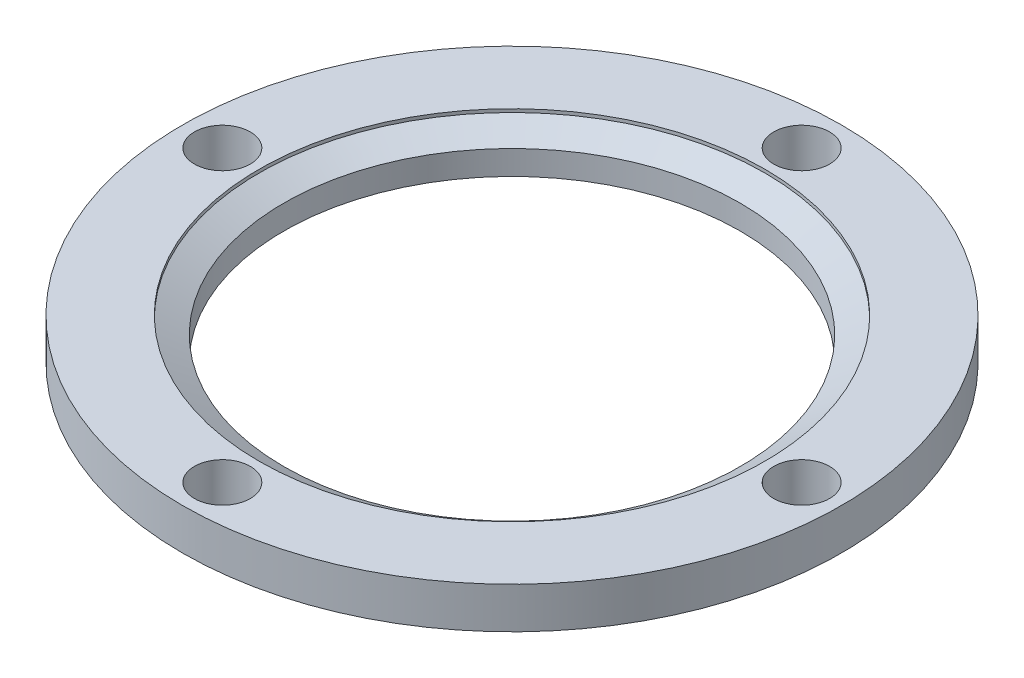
ISO-10303-21;
HEADER;
FILE_DESCRIPTION(('STEP AP214'),'2;1');
FILE_NAME('part.step','',(''),(''),'','','');
FILE_SCHEMA(('AUTOMOTIVE_DESIGN { 1 0 10303 214 1 1 1 1 }'));
ENDSEC;
DATA;
#1=APPLICATION_CONTEXT('core data for automotive mechanical design processes');
#2=APPLICATION_PROTOCOL_DEFINITION('international standard','automotive_design',2000,#1);
#3=PRODUCT_CONTEXT('',#1,'mechanical');
#4=PRODUCT('Part','Part','',(#3));
#5=PRODUCT_RELATED_PRODUCT_CATEGORY('part','',(#4));
#6=PRODUCT_DEFINITION_FORMATION('','',#4);
#7=PRODUCT_DEFINITION_CONTEXT('part definition',#1,'design');
#8=PRODUCT_DEFINITION('design','',#6,#7);
#9=PRODUCT_DEFINITION_SHAPE('','',#8);
#10=(LENGTH_UNIT() NAMED_UNIT(*) SI_UNIT(.MILLI.,.METRE.));
#11=(NAMED_UNIT(*) PLANE_ANGLE_UNIT() SI_UNIT($,.RADIAN.));
#12=(NAMED_UNIT(*) SI_UNIT($,.STERADIAN.) SOLID_ANGLE_UNIT());
#13=UNCERTAINTY_MEASURE_WITH_UNIT(LENGTH_MEASURE(1.E-05),#10,'distance_accuracy_value','');
#14=(GEOMETRIC_REPRESENTATION_CONTEXT(3) GLOBAL_UNCERTAINTY_ASSIGNED_CONTEXT((#13)) GLOBAL_UNIT_ASSIGNED_CONTEXT((#10,
#11,#12)) REPRESENTATION_CONTEXT('',''));
#15=CARTESIAN_POINT('',(0.,0.,0.));
#16=DIRECTION('',(0.,0.,1.));
#17=DIRECTION('',(1.,0.,0.));
#18=AXIS2_PLACEMENT_3D('',#15,#16,#17);
#19=CARTESIAN_POINT('',(0.,0.,0.));
#20=DIRECTION('',(0.,-1.,0.));
#21=DIRECTION('',(0.,0.,-1.));
#22=AXIS2_PLACEMENT_3D('',#19,#20,#21);
#23=CYLINDRICAL_SURFACE('',#22,17.5895);
#24=CARTESIAN_POINT('',(0.,0.,0.));
#25=DIRECTION('',(0.,-1.,0.));
#26=DIRECTION('',(0.,0.,-1.));
#27=AXIS2_PLACEMENT_3D('',#24,#25,#26);
#28=CIRCLE('',#27,17.5895);
#29=CARTESIAN_POINT('',(0.,0.,-17.5895));
#30=VERTEX_POINT('',#29);
#31=EDGE_CURVE('E10',#30,#30,#28,.T.);
#32=ORIENTED_EDGE('',*,*,#31,.T.);
#33=EDGE_LOOP('',(#32));
#34=FACE_BOUND('',#33,.T.);
#35=CARTESIAN_POINT('',(0.,1.8669,0.));
#36=DIRECTION('',(0.,-1.,0.));
#37=DIRECTION('',(0.,0.,-1.));
#38=AXIS2_PLACEMENT_3D('',#35,#36,#37);
#39=CIRCLE('',#38,17.5895);
#40=CARTESIAN_POINT('',(0.,1.8669,-17.5895));
#41=VERTEX_POINT('',#40);
#42=EDGE_CURVE('E50',#41,#41,#39,.T.);
#43=ORIENTED_EDGE('',*,*,#42,.F.);
#44=EDGE_LOOP('',(#43));
#45=FACE_BOUND('',#44,.T.);
#46=ADVANCED_FACE('F28',(#34,#45),#23,.F.);
#47=CARTESIAN_POINT('',(17.5895,0.,0.));
#48=DIRECTION('',(0.,-1.,0.));
#49=DIRECTION('',(0.,0.,-1.));
#50=AXIS2_PLACEMENT_3D('',#47,#48,#49);
#51=PLANE('',#50);
#52=CARTESIAN_POINT('',(-22.32406,0.,0.));
#53=DIRECTION('',(0.,1.,0.));
#54=DIRECTION('',(0.,0.,-1.));
#55=AXIS2_PLACEMENT_3D('',#52,#53,#54);
#56=CIRCLE('',#55,2.15265);
#57=CARTESIAN_POINT('',(-22.32406,0.,-2.15265));
#58=VERTEX_POINT('',#57);
#59=EDGE_CURVE('E71',#58,#58,#56,.T.);
#60=ORIENTED_EDGE('',*,*,#59,.T.);
#61=EDGE_LOOP('',(#60));
#62=FACE_BOUND('',#61,.T.);
#63=CARTESIAN_POINT('',(0.,0.,-22.32406));
#64=DIRECTION('',(0.,1.,0.));
#65=DIRECTION('',(0.,0.,-1.));
#66=AXIS2_PLACEMENT_3D('',#63,#64,#65);
#67=CIRCLE('',#66,2.15265);
#68=CARTESIAN_POINT('',(0.,0.,-24.47671));
#69=VERTEX_POINT('',#68);
#70=EDGE_CURVE('E65',#69,#69,#67,.T.);
#71=ORIENTED_EDGE('',*,*,#70,.T.);
#72=EDGE_LOOP('',(#71));
#73=FACE_BOUND('',#72,.T.);
#74=CARTESIAN_POINT('',(0.,0.,22.32406));
#75=DIRECTION('',(0.,1.,0.));
#76=DIRECTION('',(0.,0.,1.));
#77=AXIS2_PLACEMENT_3D('',#74,#75,#76);
#78=CIRCLE('',#77,2.15265);
#79=CARTESIAN_POINT('',(0.,0.,24.47671));
#80=VERTEX_POINT('',#79);
#81=EDGE_CURVE('E59',#80,#80,#78,.T.);
#82=ORIENTED_EDGE('',*,*,#81,.T.);
#83=EDGE_LOOP('',(#82));
#84=FACE_BOUND('',#83,.T.);
#85=CARTESIAN_POINT('',(22.32406,0.,0.));
#86=DIRECTION('',(0.,1.,0.));
#87=DIRECTION('',(0.,0.,1.));
#88=AXIS2_PLACEMENT_3D('',#85,#86,#87);
#89=CIRCLE('',#88,2.15265);
#90=CARTESIAN_POINT('',(22.32406,0.,2.15265));
#91=VERTEX_POINT('',#90);
#92=EDGE_CURVE('E53',#91,#91,#89,.T.);
#93=ORIENTED_EDGE('',*,*,#92,.T.);
#94=EDGE_LOOP('',(#93));
#95=FACE_BOUND('',#94,.T.);
#96=CARTESIAN_POINT('',(0.,0.,0.));
#97=DIRECTION('',(0.,-1.,0.));
#98=DIRECTION('',(0.,0.,-1.));
#99=AXIS2_PLACEMENT_3D('',#96,#97,#98);
#100=CIRCLE('',#99,25.4);
#101=CARTESIAN_POINT('',(0.,0.,-25.4));
#102=VERTEX_POINT('',#101);
#103=EDGE_CURVE('E34',#102,#102,#100,.T.);
#104=ORIENTED_EDGE('',*,*,#103,.T.);
#105=EDGE_LOOP('',(#104));
#106=FACE_BOUND('',#105,.T.);
#107=ORIENTED_EDGE('',*,*,#31,.F.);
#108=EDGE_LOOP('',(#107));
#109=FACE_BOUND('',#108,.T.);
#110=ADVANCED_FACE('F98',(#62,#73,#84,#95,#106,#109),#51,.T.);
#111=CARTESIAN_POINT('',(0.,0.,0.));
#112=DIRECTION('',(0.,-1.,0.));
#113=DIRECTION('',(0.,0.,-1.));
#114=AXIS2_PLACEMENT_3D('',#111,#112,#113);
#115=CYLINDRICAL_SURFACE('',#114,25.4);
#116=CARTESIAN_POINT('',(0.,3.175,0.));
#117=DIRECTION('',(0.,-1.,0.));
#118=DIRECTION('',(0.,0.,-1.));
#119=AXIS2_PLACEMENT_3D('',#116,#117,#118);
#120=CIRCLE('',#119,25.4);
#121=CARTESIAN_POINT('',(0.,3.175,-25.4));
#122=VERTEX_POINT('',#121);
#123=EDGE_CURVE('E38',#122,#122,#120,.T.);
#124=ORIENTED_EDGE('',*,*,#123,.T.);
#125=EDGE_LOOP('',(#124));
#126=FACE_BOUND('',#125,.T.);
#127=ORIENTED_EDGE('',*,*,#103,.F.);
#128=EDGE_LOOP('',(#127));
#129=FACE_BOUND('',#128,.T.);
#130=ADVANCED_FACE('F84',(#126,#129),#115,.T.);
#131=CARTESIAN_POINT('',(25.4,3.175,0.));
#132=DIRECTION('',(0.,1.,0.));
#133=DIRECTION('',(0.,0.,1.));
#134=AXIS2_PLACEMENT_3D('',#131,#132,#133);
#135=PLANE('',#134);
#136=CARTESIAN_POINT('',(-22.32406,3.175,0.));
#137=DIRECTION('',(0.,1.,0.));
#138=DIRECTION('',(0.,0.,-1.));
#139=AXIS2_PLACEMENT_3D('',#136,#137,#138);
#140=CIRCLE('',#139,2.15265);
#141=CARTESIAN_POINT('',(-22.32406,3.175,-2.15265));
#142=VERTEX_POINT('',#141);
#143=EDGE_CURVE('E74',#142,#142,#140,.T.);
#144=ORIENTED_EDGE('',*,*,#143,.F.);
#145=EDGE_LOOP('',(#144));
#146=FACE_BOUND('',#145,.T.);
#147=CARTESIAN_POINT('',(0.,3.175,-22.32406));
#148=DIRECTION('',(0.,1.,0.));
#149=DIRECTION('',(0.,0.,-1.));
#150=AXIS2_PLACEMENT_3D('',#147,#148,#149);
#151=CIRCLE('',#150,2.15265);
#152=CARTESIAN_POINT('',(0.,3.175,-24.47671));
#153=VERTEX_POINT('',#152);
#154=EDGE_CURVE('E68',#153,#153,#151,.T.);
#155=ORIENTED_EDGE('',*,*,#154,.F.);
#156=EDGE_LOOP('',(#155));
#157=FACE_BOUND('',#156,.T.);
#158=CARTESIAN_POINT('',(0.,3.175,22.32406));
#159=DIRECTION('',(0.,1.,0.));
#160=DIRECTION('',(0.,0.,1.));
#161=AXIS2_PLACEMENT_3D('',#158,#159,#160);
#162=CIRCLE('',#161,2.15265);
#163=CARTESIAN_POINT('',(0.,3.175,24.47671));
#164=VERTEX_POINT('',#163);
#165=EDGE_CURVE('E62',#164,#164,#162,.T.);
#166=ORIENTED_EDGE('',*,*,#165,.F.);
#167=EDGE_LOOP('',(#166));
#168=FACE_BOUND('',#167,.T.);
#169=CARTESIAN_POINT('',(22.32406,3.175,0.));
#170=DIRECTION('',(0.,1.,0.));
#171=DIRECTION('',(0.,0.,1.));
#172=AXIS2_PLACEMENT_3D('',#169,#170,#171);
#173=CIRCLE('',#172,2.15265);
#174=CARTESIAN_POINT('',(22.32406,3.175,2.15265));
#175=VERTEX_POINT('',#174);
#176=EDGE_CURVE('E56',#175,#175,#173,.T.);
#177=ORIENTED_EDGE('',*,*,#176,.F.);
#178=EDGE_LOOP('',(#177));
#179=FACE_BOUND('',#178,.T.);
#180=CARTESIAN_POINT('',(0.,3.175,0.));
#181=DIRECTION('',(0.,-1.,0.));
#182=DIRECTION('',(0.,0.,-1.));
#183=AXIS2_PLACEMENT_3D('',#180,#181,#182);
#184=CIRCLE('',#183,19.4945);
#185=CARTESIAN_POINT('',(0.,3.175,-19.4945));
#186=VERTEX_POINT('',#185);
#187=EDGE_CURVE('E42',#186,#186,#184,.T.);
#188=ORIENTED_EDGE('',*,*,#187,.T.);
#189=EDGE_LOOP('',(#188));
#190=FACE_BOUND('',#189,.T.);
#191=ORIENTED_EDGE('',*,*,#123,.F.);
#192=EDGE_LOOP('',(#191));
#193=FACE_BOUND('',#192,.T.);
#194=ADVANCED_FACE('F80',(#146,#157,#168,#179,#190,#193),#135,.T.);
#195=CARTESIAN_POINT('',(0.,0.,0.));
#196=DIRECTION('',(0.,-1.,0.));
#197=DIRECTION('',(0.,0.,-1.));
#198=AXIS2_PLACEMENT_3D('',#195,#196,#197);
#199=CYLINDRICAL_SURFACE('',#198,19.4945);
#200=CARTESIAN_POINT('',(0.,2.921,0.));
#201=DIRECTION('',(0.,-1.,0.));
#202=DIRECTION('',(0.,0.,-1.));
#203=AXIS2_PLACEMENT_3D('',#200,#201,#202);
#204=CIRCLE('',#203,19.4945);
#205=CARTESIAN_POINT('',(0.,2.921,-19.4945));
#206=VERTEX_POINT('',#205);
#207=EDGE_CURVE('E47',#206,#206,#204,.T.);
#208=ORIENTED_EDGE('',*,*,#207,.T.);
#209=EDGE_LOOP('',(#208));
#210=FACE_BOUND('',#209,.T.);
#211=ORIENTED_EDGE('',*,*,#187,.F.);
#212=EDGE_LOOP('',(#211));
#213=FACE_BOUND('',#212,.T.);
#214=ADVANCED_FACE('F83',(#210,#213),#199,.F.);
#215=CARTESIAN_POINT('',(0.,2.921,0.));
#216=DIRECTION('',(0.,1.,0.));
#217=DIRECTION('',(0.,0.,1.));
#218=AXIS2_PLACEMENT_3D('',#215,#216,#217);
#219=CONICAL_SURFACE('',#218,19.4945,1.0653975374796);
#220=ORIENTED_EDGE('',*,*,#42,.T.);
#221=EDGE_LOOP('',(#220));
#222=FACE_BOUND('',#221,.T.);
#223=ORIENTED_EDGE('',*,*,#207,.F.);
#224=EDGE_LOOP('',(#223));
#225=FACE_BOUND('',#224,.T.);
#226=ADVANCED_FACE('F110',(#222,#225),#219,.F.);
#227=CARTESIAN_POINT('',(22.32406,0.,0.));
#228=DIRECTION('',(0.,1.,0.));
#229=DIRECTION('',(0.,0.,1.));
#230=AXIS2_PLACEMENT_3D('',#227,#228,#229);
#231=CYLINDRICAL_SURFACE('',#230,2.15265);
#232=ORIENTED_EDGE('',*,*,#92,.F.);
#233=EDGE_LOOP('',(#232));
#234=FACE_BOUND('',#233,.T.);
#235=ORIENTED_EDGE('',*,*,#176,.T.);
#236=EDGE_LOOP('',(#235));
#237=FACE_BOUND('',#236,.T.);
#238=ADVANCED_FACE('F113',(#234,#237),#231,.F.);
#239=CARTESIAN_POINT('',(0.,0.,22.32406));
#240=DIRECTION('',(0.,1.,0.));
#241=DIRECTION('',(0.,0.,1.));
#242=AXIS2_PLACEMENT_3D('',#239,#240,#241);
#243=CYLINDRICAL_SURFACE('',#242,2.15265);
#244=ORIENTED_EDGE('',*,*,#81,.F.);
#245=EDGE_LOOP('',(#244));
#246=FACE_BOUND('',#245,.T.);
#247=ORIENTED_EDGE('',*,*,#165,.T.);
#248=EDGE_LOOP('',(#247));
#249=FACE_BOUND('',#248,.T.);
#250=ADVANCED_FACE('F125',(#246,#249),#243,.F.);
#251=CARTESIAN_POINT('',(0.,0.,-22.32406));
#252=DIRECTION('',(0.,1.,0.));
#253=DIRECTION('',(0.,0.,1.));
#254=AXIS2_PLACEMENT_3D('',#251,#252,#253);
#255=CYLINDRICAL_SURFACE('',#254,2.15265);
#256=ORIENTED_EDGE('',*,*,#70,.F.);
#257=EDGE_LOOP('',(#256));
#258=FACE_BOUND('',#257,.T.);
#259=ORIENTED_EDGE('',*,*,#154,.T.);
#260=EDGE_LOOP('',(#259));
#261=FACE_BOUND('',#260,.T.);
#262=ADVANCED_FACE('F129',(#258,#261),#255,.F.);
#263=CARTESIAN_POINT('',(-22.32406,0.,0.));
#264=DIRECTION('',(0.,1.,0.));
#265=DIRECTION('',(0.,0.,1.));
#266=AXIS2_PLACEMENT_3D('',#263,#264,#265);
#267=CYLINDRICAL_SURFACE('',#266,2.15265);
#268=ORIENTED_EDGE('',*,*,#59,.F.);
#269=EDGE_LOOP('',(#268));
#270=FACE_BOUND('',#269,.T.);
#271=ORIENTED_EDGE('',*,*,#143,.T.);
#272=EDGE_LOOP('',(#271));
#273=FACE_BOUND('',#272,.T.);
#274=ADVANCED_FACE('F78',(#270,#273),#267,.F.);
#275=CLOSED_SHELL('',(#46,#110,#130,#194,#214,#226,#238,#250,#262,#274));
#276=MANIFOLD_SOLID_BREP('B2',#275);
#277=ADVANCED_BREP_SHAPE_REPRESENTATION('',(#18,#276),#14);
#278=SHAPE_DEFINITION_REPRESENTATION(#9,#277);
ENDSEC;
END-ISO-10303-21;
